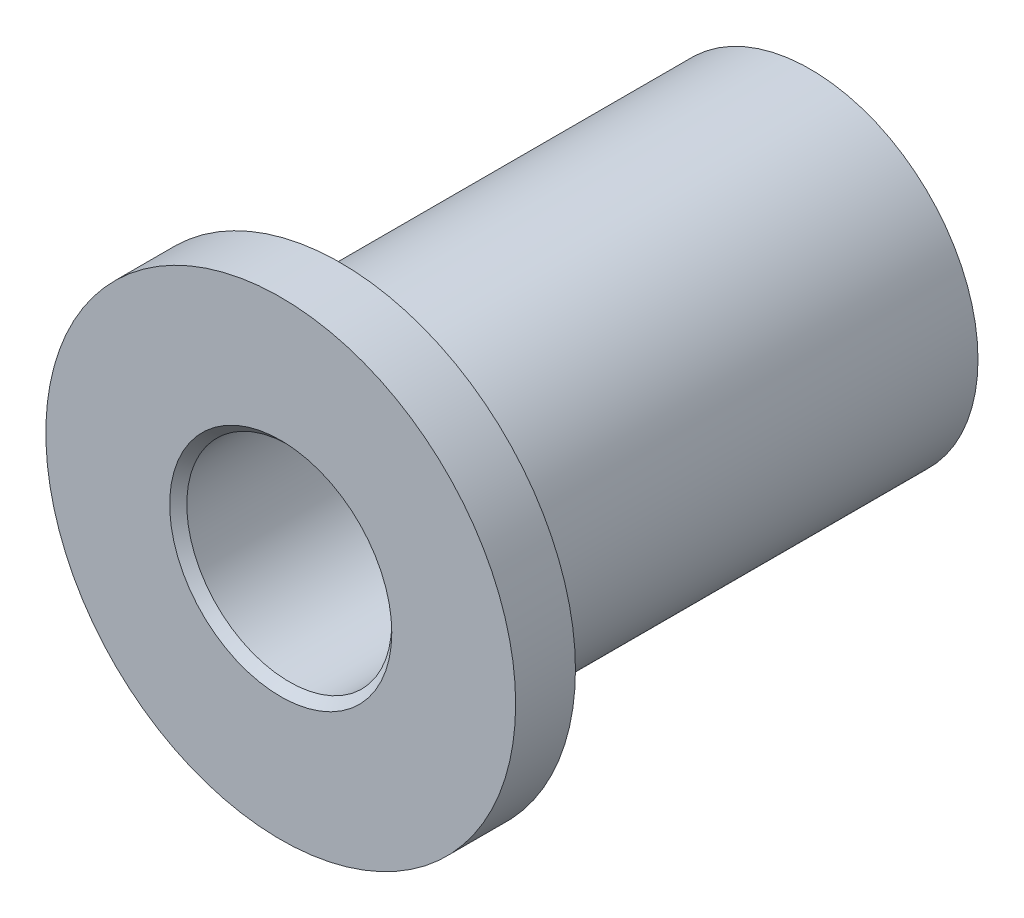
from build123d import *

# Parameters (mm, degrees)
SKETCH1_R          = 5.5
EXTRUDE1_DEPTH     = 1.4
SKETCH2_R          = 3.925
EXTRUDE2_DEPTH     = 11
SKETCH4_R          = 2.4
CUT_EXTRUDE1_DEPTH = 15.637622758
CHAMFER1_SIZE      = 0.2


with BuildPart() as part:
    # Sketch1 → Extrude1 (new body)
    with BuildSketch(Plane.XY):
        Circle(SKETCH1_R)
    extrude(amount=-EXTRUDE1_DEPTH)

    # Sketch2 → Extrude2 (add)
    with BuildSketch(Plane(origin=(0, 0, -1.4), x_dir=(-1, 0, 0), z_dir=(0, 0, -1))):
        with Locations(Location((0, 0, 0), (0, 0, 180))):
            Circle(SKETCH2_R)
    extrude(amount=EXTRUDE2_DEPTH)

    # Sketch4 → Cut-Extrude1 (cut, through all)
    with BuildSketch(Plane.XY):
        Circle(SKETCH4_R)
    extrude(amount=-CUT_EXTRUDE1_DEPTH, mode=Mode.SUBTRACT)

    # Chamfer1
    chamfer1_edges = [part.edges().sort_by_distance(p)[0] for p in [
        (-2.4, 0, 0),
    ]]
    chamfer(chamfer1_edges, length=CHAMFER1_SIZE)


solid = part.part
